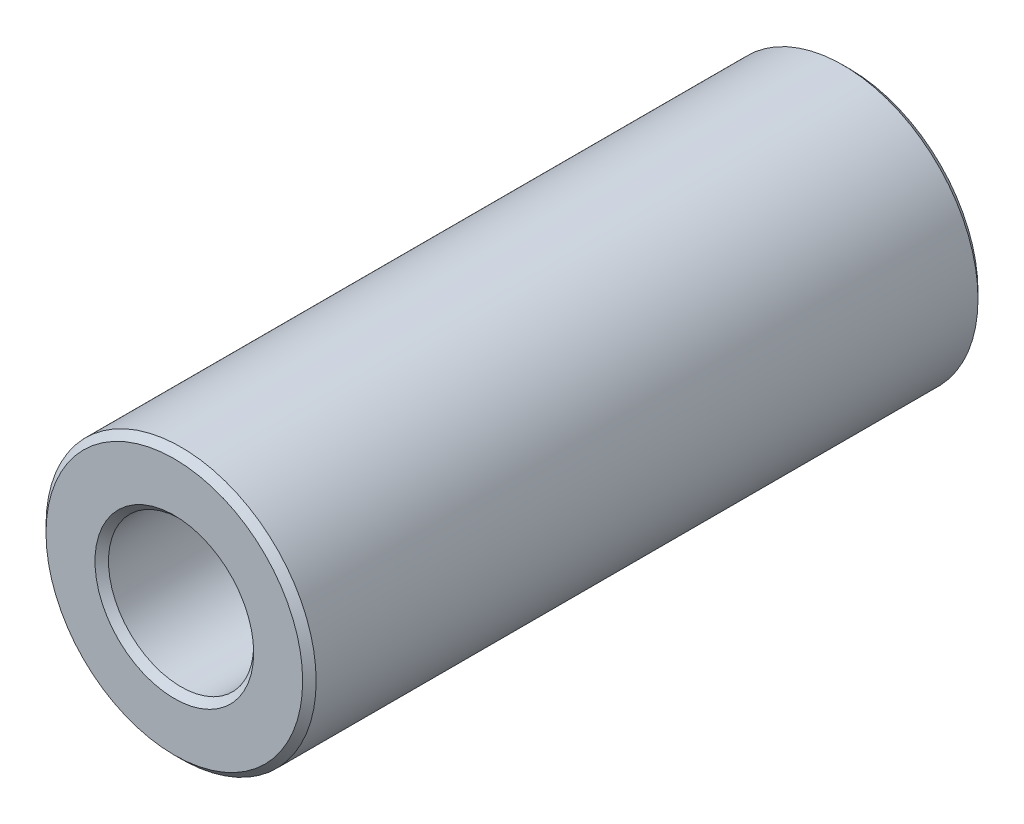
ISO-10303-21;
HEADER;
FILE_DESCRIPTION(('STEP AP214'),'2;1');
FILE_NAME('part.step','',(''),(''),'','','');
FILE_SCHEMA(('AUTOMOTIVE_DESIGN { 1 0 10303 214 1 1 1 1 }'));
ENDSEC;
DATA;
#1=APPLICATION_CONTEXT('core data for automotive mechanical design processes');
#2=APPLICATION_PROTOCOL_DEFINITION('international standard','automotive_design',2000,#1);
#3=PRODUCT_CONTEXT('',#1,'mechanical');
#4=PRODUCT('Part','Part','',(#3));
#5=PRODUCT_RELATED_PRODUCT_CATEGORY('part','',(#4));
#6=PRODUCT_DEFINITION_FORMATION('','',#4);
#7=PRODUCT_DEFINITION_CONTEXT('part definition',#1,'design');
#8=PRODUCT_DEFINITION('design','',#6,#7);
#9=PRODUCT_DEFINITION_SHAPE('','',#8);
#10=(LENGTH_UNIT() NAMED_UNIT(*) SI_UNIT(.MILLI.,.METRE.));
#11=(NAMED_UNIT(*) PLANE_ANGLE_UNIT() SI_UNIT($,.RADIAN.));
#12=(NAMED_UNIT(*) SI_UNIT($,.STERADIAN.) SOLID_ANGLE_UNIT());
#13=UNCERTAINTY_MEASURE_WITH_UNIT(LENGTH_MEASURE(1.E-05),#10,'distance_accuracy_value','');
#14=(GEOMETRIC_REPRESENTATION_CONTEXT(3) GLOBAL_UNCERTAINTY_ASSIGNED_CONTEXT((#13)) GLOBAL_UNIT_ASSIGNED_CONTEXT((#10,
#11,#12)) REPRESENTATION_CONTEXT('',''));
#15=CARTESIAN_POINT('',(0.,0.,0.));
#16=DIRECTION('',(0.,0.,1.));
#17=DIRECTION('',(1.,0.,0.));
#18=AXIS2_PLACEMENT_3D('',#15,#16,#17);
#19=CARTESIAN_POINT('',(0.,0.,10.));
#20=DIRECTION('',(0.,0.,1.));
#21=DIRECTION('',(1.,0.,0.));
#22=AXIS2_PLACEMENT_3D('',#19,#20,#21);
#23=PLANE('',#22);
#24=CARTESIAN_POINT('',(0.,0.,10.));
#25=DIRECTION('',(0.,0.,1.));
#26=DIRECTION('',(1.,0.,0.));
#27=AXIS2_PLACEMENT_3D('',#24,#25,#26);
#28=CIRCLE('',#27,2.35);
#29=CARTESIAN_POINT('',(2.35,0.,10.));
#30=VERTEX_POINT('',#29);
#31=EDGE_CURVE('E10',#30,#30,#28,.F.);
#32=ORIENTED_EDGE('',*,*,#31,.T.);
#33=EDGE_LOOP('',(#32));
#34=FACE_BOUND('',#33,.T.);
#35=CARTESIAN_POINT('',(0.,0.,10.));
#36=DIRECTION('',(0.,0.,1.));
#37=DIRECTION('',(1.,0.,0.));
#38=AXIS2_PLACEMENT_3D('',#35,#36,#37);
#39=CIRCLE('',#38,3.8);
#40=CARTESIAN_POINT('',(3.8,0.,10.));
#41=VERTEX_POINT('',#40);
#42=EDGE_CURVE('E45',#41,#41,#39,.T.);
#43=ORIENTED_EDGE('',*,*,#42,.T.);
#44=EDGE_LOOP('',(#43));
#45=FACE_BOUND('',#44,.T.);
#46=ADVANCED_FACE('F37',(#34,#45),#23,.T.);
#47=CARTESIAN_POINT('',(0.,0.,-10.));
#48=DIRECTION('',(0.,0.,1.));
#49=DIRECTION('',(1.,0.,0.));
#50=AXIS2_PLACEMENT_3D('',#47,#48,#49);
#51=PLANE('',#50);
#52=CARTESIAN_POINT('',(0.,0.,-10.));
#53=DIRECTION('',(0.,0.,1.));
#54=DIRECTION('',(1.,0.,0.));
#55=AXIS2_PLACEMENT_3D('',#52,#53,#54);
#56=CIRCLE('',#55,3.8);
#57=CARTESIAN_POINT('',(3.8,0.,-10.));
#58=VERTEX_POINT('',#57);
#59=EDGE_CURVE('E62',#58,#58,#56,.F.);
#60=ORIENTED_EDGE('',*,*,#59,.T.);
#61=EDGE_LOOP('',(#60));
#62=FACE_BOUND('',#61,.T.);
#63=CARTESIAN_POINT('',(0.,0.,-10.));
#64=DIRECTION('',(0.,0.,1.));
#65=DIRECTION('',(1.,0.,0.));
#66=AXIS2_PLACEMENT_3D('',#63,#64,#65);
#67=CIRCLE('',#66,2.35);
#68=CARTESIAN_POINT('',(2.35,0.,-10.));
#69=VERTEX_POINT('',#68);
#70=EDGE_CURVE('E66',#69,#69,#67,.T.);
#71=ORIENTED_EDGE('',*,*,#70,.T.);
#72=EDGE_LOOP('',(#71));
#73=FACE_BOUND('',#72,.T.);
#74=ADVANCED_FACE('F89',(#62,#73),#51,.F.);
#75=CARTESIAN_POINT('',(0.,0.,10.));
#76=DIRECTION('',(0.,0.,-1.));
#77=DIRECTION('',(-1.,0.,0.));
#78=AXIS2_PLACEMENT_3D('',#75,#76,#77);
#79=CYLINDRICAL_SURFACE('',#78,4.);
#80=CARTESIAN_POINT('',(0.,0.,-9.8));
#81=DIRECTION('',(0.,0.,1.));
#82=DIRECTION('',(1.,0.,0.));
#83=AXIS2_PLACEMENT_3D('',#80,#81,#82);
#84=CIRCLE('',#83,4.);
#85=CARTESIAN_POINT('',(4.,0.,-9.8));
#86=VERTEX_POINT('',#85);
#87=EDGE_CURVE('E69',#86,#86,#84,.T.);
#88=ORIENTED_EDGE('',*,*,#87,.T.);
#89=EDGE_LOOP('',(#88));
#90=FACE_BOUND('',#89,.T.);
#91=CARTESIAN_POINT('',(0.,0.,9.8));
#92=DIRECTION('',(0.,0.,1.));
#93=DIRECTION('',(1.,0.,0.));
#94=AXIS2_PLACEMENT_3D('',#91,#92,#93);
#95=CIRCLE('',#94,4.);
#96=CARTESIAN_POINT('',(4.,0.,9.8));
#97=VERTEX_POINT('',#96);
#98=EDGE_CURVE('E73',#97,#97,#95,.F.);
#99=ORIENTED_EDGE('',*,*,#98,.T.);
#100=EDGE_LOOP('',(#99));
#101=FACE_BOUND('',#100,.T.);
#102=ADVANCED_FACE('F78',(#90,#101),#79,.T.);
#103=CARTESIAN_POINT('',(0.,0.,10.));
#104=DIRECTION('',(0.,0.,-1.));
#105=DIRECTION('',(-1.,0.,0.));
#106=AXIS2_PLACEMENT_3D('',#103,#104,#105);
#107=CYLINDRICAL_SURFACE('',#106,2.15);
#108=CARTESIAN_POINT('',(0.,0.,-9.8));
#109=DIRECTION('',(0.,0.,1.));
#110=DIRECTION('',(1.,0.,0.));
#111=AXIS2_PLACEMENT_3D('',#108,#109,#110);
#112=CIRCLE('',#111,2.15);
#113=CARTESIAN_POINT('',(2.15,0.,-9.8));
#114=VERTEX_POINT('',#113);
#115=EDGE_CURVE('E52',#114,#114,#112,.F.);
#116=ORIENTED_EDGE('',*,*,#115,.T.);
#117=EDGE_LOOP('',(#116));
#118=FACE_BOUND('',#117,.T.);
#119=CARTESIAN_POINT('',(0.,0.,9.8));
#120=DIRECTION('',(0.,0.,1.));
#121=DIRECTION('',(1.,0.,0.));
#122=AXIS2_PLACEMENT_3D('',#119,#120,#121);
#123=CIRCLE('',#122,2.15);
#124=CARTESIAN_POINT('',(2.15,0.,9.8));
#125=VERTEX_POINT('',#124);
#126=EDGE_CURVE('E57',#125,#125,#123,.T.);
#127=ORIENTED_EDGE('',*,*,#126,.T.);
#128=EDGE_LOOP('',(#127));
#129=FACE_BOUND('',#128,.T.);
#130=ADVANCED_FACE('F97',(#118,#129),#107,.F.);
#131=CARTESIAN_POINT('',(0.,0.,-9.8));
#132=DIRECTION('',(0.,0.,1.));
#133=DIRECTION('',(1.,0.,0.));
#134=AXIS2_PLACEMENT_3D('',#131,#132,#133);
#135=CONICAL_SURFACE('',#134,4.,0.785398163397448);
#136=ORIENTED_EDGE('',*,*,#59,.F.);
#137=EDGE_LOOP('',(#136));
#138=FACE_BOUND('',#137,.T.);
#139=ORIENTED_EDGE('',*,*,#87,.F.);
#140=EDGE_LOOP('',(#139));
#141=FACE_BOUND('',#140,.T.);
#142=ADVANCED_FACE('F102',(#138,#141),#135,.T.);
#143=CARTESIAN_POINT('',(0.,0.,-10.));
#144=DIRECTION('',(0.,0.,-1.));
#145=DIRECTION('',(-1.,0.,0.));
#146=AXIS2_PLACEMENT_3D('',#143,#144,#145);
#147=CONICAL_SURFACE('',#146,2.35,0.785398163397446);
#148=ORIENTED_EDGE('',*,*,#115,.F.);
#149=EDGE_LOOP('',(#148));
#150=FACE_BOUND('',#149,.T.);
#151=ORIENTED_EDGE('',*,*,#70,.F.);
#152=EDGE_LOOP('',(#151));
#153=FACE_BOUND('',#152,.T.);
#154=ADVANCED_FACE('F86',(#150,#153),#147,.F.);
#155=CARTESIAN_POINT('',(0.,0.,9.8));
#156=DIRECTION('',(0.,0.,1.));
#157=DIRECTION('',(1.,0.,0.));
#158=AXIS2_PLACEMENT_3D('',#155,#156,#157);
#159=CONICAL_SURFACE('',#158,2.15,0.785398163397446);
#160=ORIENTED_EDGE('',*,*,#31,.F.);
#161=EDGE_LOOP('',(#160));
#162=FACE_BOUND('',#161,.T.);
#163=ORIENTED_EDGE('',*,*,#126,.F.);
#164=EDGE_LOOP('',(#163));
#165=FACE_BOUND('',#164,.T.);
#166=ADVANCED_FACE('F82',(#162,#165),#159,.F.);
#167=CARTESIAN_POINT('',(0.,0.,10.));
#168=DIRECTION('',(0.,0.,-1.));
#169=DIRECTION('',(-1.,0.,0.));
#170=AXIS2_PLACEMENT_3D('',#167,#168,#169);
#171=CONICAL_SURFACE('',#170,3.8,0.785398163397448);
#172=ORIENTED_EDGE('',*,*,#98,.F.);
#173=EDGE_LOOP('',(#172));
#174=FACE_BOUND('',#173,.T.);
#175=ORIENTED_EDGE('',*,*,#42,.F.);
#176=EDGE_LOOP('',(#175));
#177=FACE_BOUND('',#176,.T.);
#178=ADVANCED_FACE('F39',(#174,#177),#171,.T.);
#179=CLOSED_SHELL('',(#46,#74,#102,#130,#142,#154,#166,#178));
#180=MANIFOLD_SOLID_BREP('B2',#179);
#181=ADVANCED_BREP_SHAPE_REPRESENTATION('',(#18,#180),#14);
#182=SHAPE_DEFINITION_REPRESENTATION(#9,#181);
ENDSEC;
END-ISO-10303-21;
